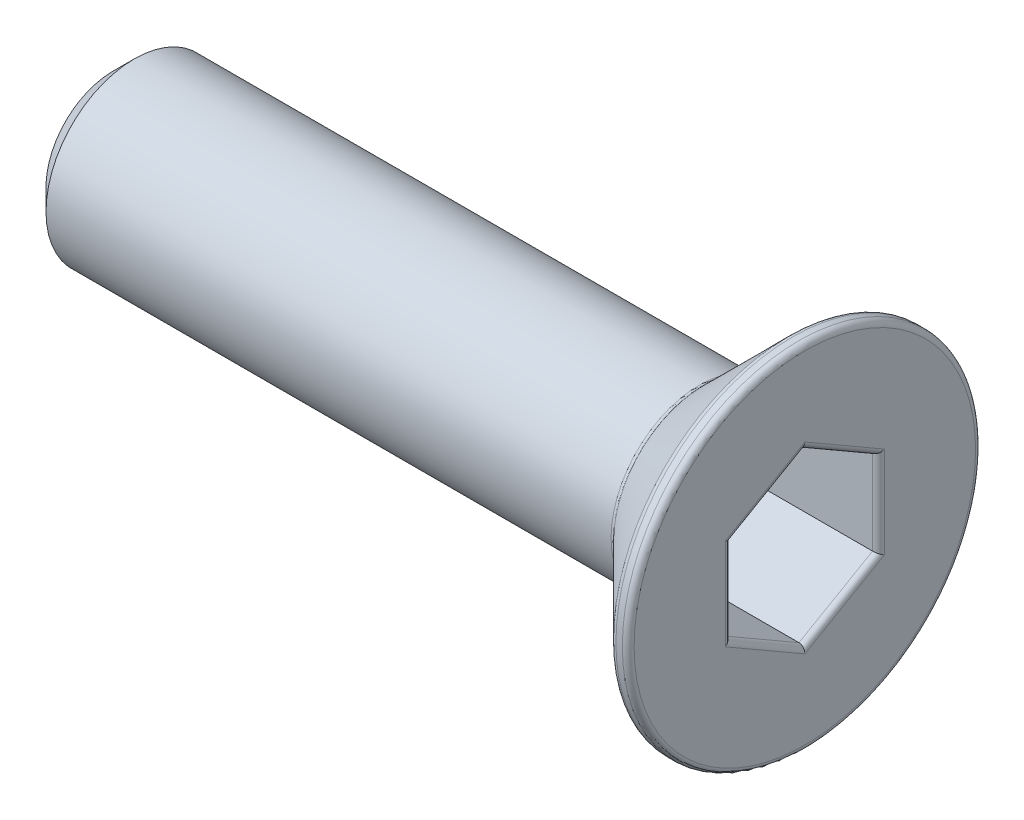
from build123d import *

# Parameters (mm, degrees)
ENL_V_MAT_EXTRU_1_DEPTH = 2
CONG_1_R                = 0.1


with BuildPart() as part:
    # Esquisse1 → R_volution1 (revolve)
    with BuildSketch(Plane.XY, mode=Mode.PRIVATE) as r_volution1_sk:
        Polygon((0, 0), (0, 1.5), (10, 1.5), (11.5, 3), (11.75, 3), (11.75, 0), align=None)
    revolve(r_volution1_sk.sketch.rotate(Axis((0, 0, 0), (1, 0, 0)), 90), axis=Axis((0, 0, 0), (1, 0, 0)))

    # Esquisse2 → Enl_v. mat.-Extru.1 (cut)
    with BuildSketch(Plane(origin=(11.75, 0, 0), x_dir=(0, 0, -1), z_dir=(1, 0, 0))):
        Polygon((-6.61e-07, -1.443375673), (1.249999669, -0.721688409), (1.250000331, 0.721687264), (6.61e-07, 1.443375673), (-1.249999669, 0.721688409), (-1.250000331, -0.721687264), align=None)
    extrude(amount=-ENL_V_MAT_EXTRU_1_DEPTH, mode=Mode.SUBTRACT)

    # Esquisse5 → Enl_vement de mati_re-R_volution1 (revolve, cut)
    with BuildSketch(Plane.XY, mode=Mode.PRIVATE) as enl_vement_de_mati_re_r_volution1_sk:
        Polygon((1.135512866, 2.274154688), (-0.693244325, 2.274154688), (-0.693244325, 0), (-0.360767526, 0), (-0.360767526, 0.777874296), align=None)
    revolve(enl_vement_de_mati_re_r_volution1_sk.sketch.rotate(Axis((0, 0, 0), (1, 0, 0)), 90), axis=Axis((0, 0, 0), (1, 0, 0)), mode=Mode.SUBTRACT)

    # Cong_1
    cong_1_edges = [part.edges().sort_by_distance(p)[0] for p in [
        (10, 0, -1.5),
        (11.5, 0, -3),
        (11.75, 0, -3),
        (11.75, -1.082532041, -0.624999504),
        (11.75, -5.73e-07, -1.25),
        (11.75, 1.082531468, -0.625000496),
        (11.75, 1.082532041, 0.624999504),
        (11.75, 5.73e-07, 1.25),
        (11.75, -1.082531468, 0.625000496),
    ]]
    fillet(cong_1_edges, radius=CONG_1_R)


solid = part.part
